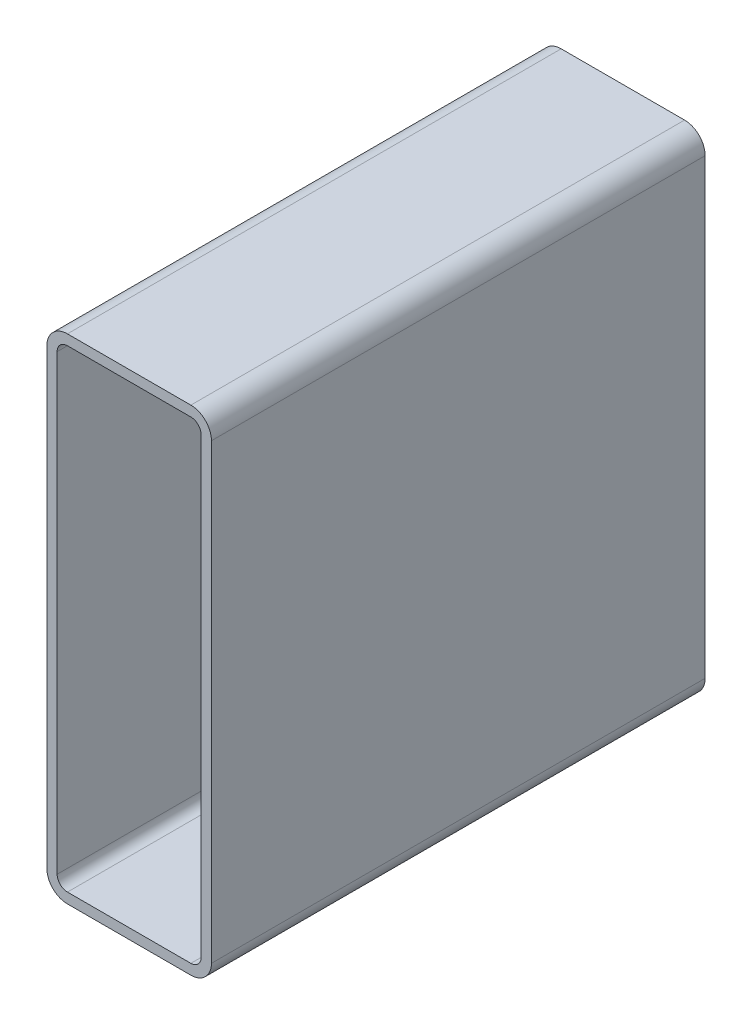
ISO-10303-21;
HEADER;
FILE_DESCRIPTION(('STEP AP214'),'2;1');
FILE_NAME('part.step','',(''),(''),'','','');
FILE_SCHEMA(('AUTOMOTIVE_DESIGN { 1 0 10303 214 1 1 1 1 }'));
ENDSEC;
DATA;
#1=APPLICATION_CONTEXT('core data for automotive mechanical design processes');
#2=APPLICATION_PROTOCOL_DEFINITION('international standard','automotive_design',2000,#1);
#3=PRODUCT_CONTEXT('',#1,'mechanical');
#4=PRODUCT('Part','Part','',(#3));
#5=PRODUCT_RELATED_PRODUCT_CATEGORY('part','',(#4));
#6=PRODUCT_DEFINITION_FORMATION('','',#4);
#7=PRODUCT_DEFINITION_CONTEXT('part definition',#1,'design');
#8=PRODUCT_DEFINITION('design','',#6,#7);
#9=PRODUCT_DEFINITION_SHAPE('','',#8);
#10=(LENGTH_UNIT() NAMED_UNIT(*) SI_UNIT(.MILLI.,.METRE.));
#11=(NAMED_UNIT(*) PLANE_ANGLE_UNIT() SI_UNIT($,.RADIAN.));
#12=(NAMED_UNIT(*) SI_UNIT($,.STERADIAN.) SOLID_ANGLE_UNIT());
#13=UNCERTAINTY_MEASURE_WITH_UNIT(LENGTH_MEASURE(1.E-05),#10,'distance_accuracy_value','');
#14=(GEOMETRIC_REPRESENTATION_CONTEXT(3) GLOBAL_UNCERTAINTY_ASSIGNED_CONTEXT((#13)) GLOBAL_UNIT_ASSIGNED_CONTEXT((#10,
#11,#12)) REPRESENTATION_CONTEXT('',''));
#15=CARTESIAN_POINT('',(0.,0.,0.));
#16=DIRECTION('',(0.,0.,1.));
#17=DIRECTION('',(1.,0.,0.));
#18=AXIS2_PLACEMENT_3D('',#15,#16,#17);
#19=CARTESIAN_POINT('',(14.3751778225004,293.974496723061,304.8));
#20=DIRECTION('',(0.,0.,1.));
#21=DIRECTION('',(1.,0.,0.));
#22=AXIS2_PLACEMENT_3D('',#19,#20,#21);
#23=PLANE('',#22);
#24=CARTESIAN_POINT('',(14.3751778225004,293.974496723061,304.8));
#25=DIRECTION('',(0.,0.,1.));
#26=DIRECTION('',(1.,0.,0.));
#27=AXIS2_PLACEMENT_3D('',#24,#25,#26);
#28=CIRCLE('',#27,12.7);
#29=CARTESIAN_POINT('',(14.3751778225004,306.674496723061,304.8));
#30=VERTEX_POINT('',#29);
#31=CARTESIAN_POINT('',(1.67517782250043,293.974496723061,304.8));
#32=VERTEX_POINT('',#31);
#33=EDGE_CURVE('E211',#30,#32,#28,.T.);
#34=ORIENTED_EDGE('',*,*,#33,.T.);
#35=DIRECTION('',(0.,-1.,0.));
#36=VECTOR('',#35,1.);
#37=CARTESIAN_POINT('',(1.67517782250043,14.5744967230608,304.8));
#38=LINE('',#37,#36);
#39=CARTESIAN_POINT('',(1.67517782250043,14.5744967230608,304.8));
#40=VERTEX_POINT('',#39);
#41=EDGE_CURVE('E214',#32,#40,#38,.T.);
#42=ORIENTED_EDGE('',*,*,#41,.T.);
#43=CARTESIAN_POINT('',(14.3751778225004,14.5744967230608,304.8));
#44=DIRECTION('',(0.,0.,1.));
#45=DIRECTION('',(1.,0.,0.));
#46=AXIS2_PLACEMENT_3D('',#43,#44,#45);
#47=CIRCLE('',#46,12.7);
#48=CARTESIAN_POINT('',(14.3751778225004,1.87449672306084,304.8));
#49=VERTEX_POINT('',#48);
#50=EDGE_CURVE('E217',#40,#49,#47,.T.);
#51=ORIENTED_EDGE('',*,*,#50,.T.);
#52=DIRECTION('',(1.,0.,0.));
#53=VECTOR('',#52,1.);
#54=CARTESIAN_POINT('',(90.5751778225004,1.87449672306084,304.8));
#55=LINE('',#54,#53);
#56=CARTESIAN_POINT('',(90.5751778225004,1.87449672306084,304.8));
#57=VERTEX_POINT('',#56);
#58=EDGE_CURVE('E219',#49,#57,#55,.T.);
#59=ORIENTED_EDGE('',*,*,#58,.T.);
#60=CARTESIAN_POINT('',(90.5751778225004,14.5744967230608,304.8));
#61=DIRECTION('',(0.,0.,1.));
#62=DIRECTION('',(1.,0.,0.));
#63=AXIS2_PLACEMENT_3D('',#60,#61,#62);
#64=CIRCLE('',#63,12.7);
#65=CARTESIAN_POINT('',(103.2751778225,14.5744967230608,304.8));
#66=VERTEX_POINT('',#65);
#67=EDGE_CURVE('E221',#57,#66,#64,.T.);
#68=ORIENTED_EDGE('',*,*,#67,.T.);
#69=DIRECTION('',(0.,1.,0.));
#70=VECTOR('',#69,1.);
#71=CARTESIAN_POINT('',(103.2751778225,293.974496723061,304.8));
#72=LINE('',#71,#70);
#73=CARTESIAN_POINT('',(103.2751778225,293.974496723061,304.8));
#74=VERTEX_POINT('',#73);
#75=EDGE_CURVE('E223',#66,#74,#72,.T.);
#76=ORIENTED_EDGE('',*,*,#75,.T.);
#77=CARTESIAN_POINT('',(90.5751778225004,293.974496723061,304.8));
#78=DIRECTION('',(0.,0.,1.));
#79=DIRECTION('',(1.,0.,0.));
#80=AXIS2_PLACEMENT_3D('',#77,#78,#79);
#81=CIRCLE('',#80,12.7);
#82=CARTESIAN_POINT('',(90.5751778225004,306.674496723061,304.8));
#83=VERTEX_POINT('',#82);
#84=EDGE_CURVE('E225',#74,#83,#81,.T.);
#85=ORIENTED_EDGE('',*,*,#84,.T.);
#86=DIRECTION('',(-1.,0.,0.));
#87=VECTOR('',#86,1.);
#88=CARTESIAN_POINT('',(14.3751778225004,306.674496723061,304.8));
#89=LINE('',#88,#87);
#90=EDGE_CURVE('E227',#83,#30,#89,.T.);
#91=ORIENTED_EDGE('',*,*,#90,.T.);
#92=EDGE_LOOP('',(#34,#42,#51,#59,#68,#76,#85,#91));
#93=FACE_BOUND('',#92,.T.);
#94=DIRECTION('',(0.,-1.,0.));
#95=VECTOR('',#94,1.);
#96=CARTESIAN_POINT('',(8.02517782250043,14.5744967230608,304.8));
#97=LINE('',#96,#95);
#98=CARTESIAN_POINT('',(8.02517782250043,293.974496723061,304.8));
#99=VERTEX_POINT('',#98);
#100=CARTESIAN_POINT('',(8.02517782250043,14.5744967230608,304.8));
#101=VERTEX_POINT('',#100);
#102=EDGE_CURVE('E154',#99,#101,#97,.T.);
#103=ORIENTED_EDGE('',*,*,#102,.F.);
#104=CARTESIAN_POINT('',(14.3751778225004,293.974496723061,304.8));
#105=DIRECTION('',(0.,0.,1.));
#106=DIRECTION('',(1.,0.,0.));
#107=AXIS2_PLACEMENT_3D('',#104,#105,#106);
#108=CIRCLE('',#107,6.35000000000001);
#109=CARTESIAN_POINT('',(14.3751778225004,300.324496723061,304.8));
#110=VERTEX_POINT('',#109);
#111=EDGE_CURVE('E146',#110,#99,#108,.T.);
#112=ORIENTED_EDGE('',*,*,#111,.F.);
#113=DIRECTION('',(-1.,0.,0.));
#114=VECTOR('',#113,1.);
#115=CARTESIAN_POINT('',(14.3751778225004,300.324496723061,304.8));
#116=LINE('',#115,#114);
#117=CARTESIAN_POINT('',(90.5751778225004,300.324496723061,304.8));
#118=VERTEX_POINT('',#117);
#119=EDGE_CURVE('E179',#118,#110,#116,.T.);
#120=ORIENTED_EDGE('',*,*,#119,.F.);
#121=CARTESIAN_POINT('',(90.5751778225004,293.974496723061,304.8));
#122=DIRECTION('',(0.,0.,1.));
#123=DIRECTION('',(1.,0.,0.));
#124=AXIS2_PLACEMENT_3D('',#121,#122,#123);
#125=CIRCLE('',#124,6.35000000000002);
#126=CARTESIAN_POINT('',(96.9251778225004,293.974496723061,304.8));
#127=VERTEX_POINT('',#126);
#128=EDGE_CURVE('E177',#127,#118,#125,.T.);
#129=ORIENTED_EDGE('',*,*,#128,.F.);
#130=DIRECTION('',(0.,1.,0.));
#131=VECTOR('',#130,1.);
#132=CARTESIAN_POINT('',(96.9251778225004,293.974496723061,304.8));
#133=LINE('',#132,#131);
#134=CARTESIAN_POINT('',(96.9251778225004,14.5744967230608,304.8));
#135=VERTEX_POINT('',#134);
#136=EDGE_CURVE('E175',#135,#127,#133,.T.);
#137=ORIENTED_EDGE('',*,*,#136,.F.);
#138=CARTESIAN_POINT('',(90.5751778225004,14.5744967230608,304.8));
#139=DIRECTION('',(0.,0.,1.));
#140=DIRECTION('',(1.,0.,0.));
#141=AXIS2_PLACEMENT_3D('',#138,#139,#140);
#142=CIRCLE('',#141,6.35000000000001);
#143=CARTESIAN_POINT('',(90.5751778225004,8.22449672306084,304.8));
#144=VERTEX_POINT('',#143);
#145=EDGE_CURVE('E173',#144,#135,#142,.T.);
#146=ORIENTED_EDGE('',*,*,#145,.F.);
#147=DIRECTION('',(1.,0.,0.));
#148=VECTOR('',#147,1.);
#149=CARTESIAN_POINT('',(90.5751778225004,8.22449672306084,304.8));
#150=LINE('',#149,#148);
#151=CARTESIAN_POINT('',(14.3751778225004,8.22449672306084,304.8));
#152=VERTEX_POINT('',#151);
#153=EDGE_CURVE('E169',#152,#144,#150,.T.);
#154=ORIENTED_EDGE('',*,*,#153,.F.);
#155=CARTESIAN_POINT('',(14.3751778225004,14.5744967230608,304.8));
#156=DIRECTION('',(0.,0.,1.));
#157=DIRECTION('',(1.,0.,0.));
#158=AXIS2_PLACEMENT_3D('',#155,#156,#157);
#159=CIRCLE('',#158,6.35);
#160=EDGE_CURVE('E167',#101,#152,#159,.T.);
#161=ORIENTED_EDGE('',*,*,#160,.F.);
#162=EDGE_LOOP('',(#103,#112,#120,#129,#137,#146,#154,#161));
#163=FACE_BOUND('',#162,.T.);
#164=ADVANCED_FACE('F33',(#93,#163),#23,.T.);
#165=CARTESIAN_POINT('',(14.3751778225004,293.974496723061,0.));
#166=DIRECTION('',(0.,0.,1.));
#167=DIRECTION('',(1.,0.,0.));
#168=AXIS2_PLACEMENT_3D('',#165,#166,#167);
#169=PLANE('',#168);
#170=CARTESIAN_POINT('',(14.3751778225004,293.974496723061,0.));
#171=DIRECTION('',(0.,0.,1.));
#172=DIRECTION('',(1.,0.,0.));
#173=AXIS2_PLACEMENT_3D('',#170,#171,#172);
#174=CIRCLE('',#173,12.7);
#175=CARTESIAN_POINT('',(14.3751778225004,306.674496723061,0.));
#176=VERTEX_POINT('',#175);
#177=CARTESIAN_POINT('',(1.67517782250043,293.974496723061,0.));
#178=VERTEX_POINT('',#177);
#179=EDGE_CURVE('E162',#176,#178,#174,.T.);
#180=ORIENTED_EDGE('',*,*,#179,.F.);
#181=DIRECTION('',(-1.,0.,0.));
#182=VECTOR('',#181,1.);
#183=CARTESIAN_POINT('',(14.3751778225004,306.674496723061,0.));
#184=LINE('',#183,#182);
#185=CARTESIAN_POINT('',(90.5751778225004,306.674496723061,0.));
#186=VERTEX_POINT('',#185);
#187=EDGE_CURVE('E215',#186,#176,#184,.T.);
#188=ORIENTED_EDGE('',*,*,#187,.F.);
#189=CARTESIAN_POINT('',(90.5751778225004,293.974496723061,0.));
#190=DIRECTION('',(0.,0.,1.));
#191=DIRECTION('',(1.,0.,0.));
#192=AXIS2_PLACEMENT_3D('',#189,#190,#191);
#193=CIRCLE('',#192,12.7);
#194=CARTESIAN_POINT('',(103.2751778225,293.974496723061,0.));
#195=VERTEX_POINT('',#194);
#196=EDGE_CURVE('E242',#195,#186,#193,.T.);
#197=ORIENTED_EDGE('',*,*,#196,.F.);
#198=DIRECTION('',(0.,1.,0.));
#199=VECTOR('',#198,1.);
#200=CARTESIAN_POINT('',(103.2751778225,293.974496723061,0.));
#201=LINE('',#200,#199);
#202=CARTESIAN_POINT('',(103.2751778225,14.5744967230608,0.));
#203=VERTEX_POINT('',#202);
#204=EDGE_CURVE('E240',#203,#195,#201,.T.);
#205=ORIENTED_EDGE('',*,*,#204,.F.);
#206=CARTESIAN_POINT('',(90.5751778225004,14.5744967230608,0.));
#207=DIRECTION('',(0.,0.,1.));
#208=DIRECTION('',(1.,0.,0.));
#209=AXIS2_PLACEMENT_3D('',#206,#207,#208);
#210=CIRCLE('',#209,12.7);
#211=CARTESIAN_POINT('',(90.5751778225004,1.87449672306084,0.));
#212=VERTEX_POINT('',#211);
#213=EDGE_CURVE('E238',#212,#203,#210,.T.);
#214=ORIENTED_EDGE('',*,*,#213,.F.);
#215=DIRECTION('',(1.,0.,0.));
#216=VECTOR('',#215,1.);
#217=CARTESIAN_POINT('',(90.5751778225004,1.87449672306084,0.));
#218=LINE('',#217,#216);
#219=CARTESIAN_POINT('',(14.3751778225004,1.87449672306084,0.));
#220=VERTEX_POINT('',#219);
#221=EDGE_CURVE('E236',#220,#212,#218,.T.);
#222=ORIENTED_EDGE('',*,*,#221,.F.);
#223=CARTESIAN_POINT('',(14.3751778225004,14.5744967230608,0.));
#224=DIRECTION('',(0.,0.,1.));
#225=DIRECTION('',(1.,0.,0.));
#226=AXIS2_PLACEMENT_3D('',#223,#224,#225);
#227=CIRCLE('',#226,12.7);
#228=CARTESIAN_POINT('',(1.67517782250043,14.5744967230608,0.));
#229=VERTEX_POINT('',#228);
#230=EDGE_CURVE('E234',#229,#220,#227,.T.);
#231=ORIENTED_EDGE('',*,*,#230,.F.);
#232=DIRECTION('',(0.,-1.,0.));
#233=VECTOR('',#232,1.);
#234=CARTESIAN_POINT('',(1.67517782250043,14.5744967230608,0.));
#235=LINE('',#234,#233);
#236=EDGE_CURVE('E232',#178,#229,#235,.T.);
#237=ORIENTED_EDGE('',*,*,#236,.F.);
#238=EDGE_LOOP('',(#180,#188,#197,#205,#214,#222,#231,#237));
#239=FACE_BOUND('',#238,.T.);
#240=CARTESIAN_POINT('',(14.3751778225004,293.974496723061,0.));
#241=DIRECTION('',(0.,0.,1.));
#242=DIRECTION('',(1.,0.,0.));
#243=AXIS2_PLACEMENT_3D('',#240,#241,#242);
#244=CIRCLE('',#243,6.35000000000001);
#245=CARTESIAN_POINT('',(14.3751778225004,300.324496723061,0.));
#246=VERTEX_POINT('',#245);
#247=CARTESIAN_POINT('',(8.02517782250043,293.974496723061,0.));
#248=VERTEX_POINT('',#247);
#249=EDGE_CURVE('E56',#246,#248,#244,.T.);
#250=ORIENTED_EDGE('',*,*,#249,.T.);
#251=DIRECTION('',(0.,-1.,0.));
#252=VECTOR('',#251,1.);
#253=CARTESIAN_POINT('',(8.02517782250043,14.5744967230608,0.));
#254=LINE('',#253,#252);
#255=CARTESIAN_POINT('',(8.02517782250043,14.5744967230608,0.));
#256=VERTEX_POINT('',#255);
#257=EDGE_CURVE('E161',#248,#256,#254,.T.);
#258=ORIENTED_EDGE('',*,*,#257,.T.);
#259=CARTESIAN_POINT('',(14.3751778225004,14.5744967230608,0.));
#260=DIRECTION('',(0.,0.,1.));
#261=DIRECTION('',(1.,0.,0.));
#262=AXIS2_PLACEMENT_3D('',#259,#260,#261);
#263=CIRCLE('',#262,6.35);
#264=CARTESIAN_POINT('',(14.3751778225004,8.22449672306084,0.));
#265=VERTEX_POINT('',#264);
#266=EDGE_CURVE('E183',#256,#265,#263,.T.);
#267=ORIENTED_EDGE('',*,*,#266,.T.);
#268=DIRECTION('',(1.,0.,0.));
#269=VECTOR('',#268,1.);
#270=CARTESIAN_POINT('',(90.5751778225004,8.22449672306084,0.));
#271=LINE('',#270,#269);
#272=CARTESIAN_POINT('',(90.5751778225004,8.22449672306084,0.));
#273=VERTEX_POINT('',#272);
#274=EDGE_CURVE('E186',#265,#273,#271,.T.);
#275=ORIENTED_EDGE('',*,*,#274,.T.);
#276=CARTESIAN_POINT('',(90.5751778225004,14.5744967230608,0.));
#277=DIRECTION('',(0.,0.,1.));
#278=DIRECTION('',(1.,0.,0.));
#279=AXIS2_PLACEMENT_3D('',#276,#277,#278);
#280=CIRCLE('',#279,6.35000000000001);
#281=CARTESIAN_POINT('',(96.9251778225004,14.5744967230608,0.));
#282=VERTEX_POINT('',#281);
#283=EDGE_CURVE('E189',#273,#282,#280,.T.);
#284=ORIENTED_EDGE('',*,*,#283,.T.);
#285=DIRECTION('',(0.,1.,0.));
#286=VECTOR('',#285,1.);
#287=CARTESIAN_POINT('',(96.9251778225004,293.974496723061,0.));
#288=LINE('',#287,#286);
#289=CARTESIAN_POINT('',(96.9251778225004,293.974496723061,0.));
#290=VERTEX_POINT('',#289);
#291=EDGE_CURVE('E192',#282,#290,#288,.T.);
#292=ORIENTED_EDGE('',*,*,#291,.T.);
#293=CARTESIAN_POINT('',(90.5751778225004,293.974496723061,0.));
#294=DIRECTION('',(0.,0.,1.));
#295=DIRECTION('',(1.,0.,0.));
#296=AXIS2_PLACEMENT_3D('',#293,#294,#295);
#297=CIRCLE('',#296,6.35000000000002);
#298=CARTESIAN_POINT('',(90.5751778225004,300.324496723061,0.));
#299=VERTEX_POINT('',#298);
#300=EDGE_CURVE('E195',#290,#299,#297,.T.);
#301=ORIENTED_EDGE('',*,*,#300,.T.);
#302=DIRECTION('',(-1.,0.,0.));
#303=VECTOR('',#302,1.);
#304=CARTESIAN_POINT('',(14.3751778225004,300.324496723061,0.));
#305=LINE('',#304,#303);
#306=EDGE_CURVE('E155',#299,#246,#305,.T.);
#307=ORIENTED_EDGE('',*,*,#306,.T.);
#308=EDGE_LOOP('',(#250,#258,#267,#275,#284,#292,#301,#307));
#309=FACE_BOUND('',#308,.T.);
#310=ADVANCED_FACE('F272',(#239,#309),#169,.F.);
#311=CARTESIAN_POINT('',(14.3751778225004,293.974496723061,304.8));
#312=DIRECTION('',(0.,0.,-1.));
#313=DIRECTION('',(-1.,0.,0.));
#314=AXIS2_PLACEMENT_3D('',#311,#312,#313);
#315=CYLINDRICAL_SURFACE('',#314,12.7);
#316=ORIENTED_EDGE('',*,*,#179,.T.);
#317=DIRECTION('',(0.,0.,-1.));
#318=VECTOR('',#317,1.);
#319=CARTESIAN_POINT('',(1.67517782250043,293.974496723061,304.8));
#320=LINE('',#319,#318);
#321=EDGE_CURVE('E11',#32,#178,#320,.T.);
#322=ORIENTED_EDGE('',*,*,#321,.F.);
#323=ORIENTED_EDGE('',*,*,#33,.F.);
#324=DIRECTION('',(0.,0.,-1.));
#325=VECTOR('',#324,1.);
#326=CARTESIAN_POINT('',(14.3751778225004,306.674496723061,304.8));
#327=LINE('',#326,#325);
#328=EDGE_CURVE('E229',#30,#176,#327,.T.);
#329=ORIENTED_EDGE('',*,*,#328,.T.);
#330=EDGE_LOOP('',(#316,#322,#323,#329));
#331=FACE_BOUND('',#330,.T.);
#332=ADVANCED_FACE('F35',(#331),#315,.T.);
#333=CARTESIAN_POINT('',(1.67517782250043,14.5744967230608,304.8));
#334=DIRECTION('',(1.,0.,0.));
#335=DIRECTION('',(0.,0.,-1.));
#336=AXIS2_PLACEMENT_3D('',#333,#334,#335);
#337=PLANE('',#336);
#338=ORIENTED_EDGE('',*,*,#236,.T.);
#339=DIRECTION('',(0.,0.,-1.));
#340=VECTOR('',#339,1.);
#341=CARTESIAN_POINT('',(1.67517782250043,14.5744967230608,304.8));
#342=LINE('',#341,#340);
#343=EDGE_CURVE('E41',#40,#229,#342,.T.);
#344=ORIENTED_EDGE('',*,*,#343,.F.);
#345=ORIENTED_EDGE('',*,*,#41,.F.);
#346=ORIENTED_EDGE('',*,*,#321,.T.);
#347=EDGE_LOOP('',(#338,#344,#345,#346));
#348=FACE_BOUND('',#347,.T.);
#349=ADVANCED_FACE('F289',(#348),#337,.F.);
#350=CARTESIAN_POINT('',(14.3751778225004,14.5744967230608,304.8));
#351=DIRECTION('',(0.,0.,-1.));
#352=DIRECTION('',(-1.,0.,0.));
#353=AXIS2_PLACEMENT_3D('',#350,#351,#352);
#354=CYLINDRICAL_SURFACE('',#353,12.7);
#355=ORIENTED_EDGE('',*,*,#230,.T.);
#356=DIRECTION('',(0.,0.,-1.));
#357=VECTOR('',#356,1.);
#358=CARTESIAN_POINT('',(14.3751778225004,1.87449672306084,304.8));
#359=LINE('',#358,#357);
#360=EDGE_CURVE('E259',#49,#220,#359,.T.);
#361=ORIENTED_EDGE('',*,*,#360,.F.);
#362=ORIENTED_EDGE('',*,*,#50,.F.);
#363=ORIENTED_EDGE('',*,*,#343,.T.);
#364=EDGE_LOOP('',(#355,#361,#362,#363));
#365=FACE_BOUND('',#364,.T.);
#366=ADVANCED_FACE('F266',(#365),#354,.T.);
#367=CARTESIAN_POINT('',(90.5751778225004,1.87449672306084,304.8));
#368=DIRECTION('',(0.,1.,0.));
#369=DIRECTION('',(0.,0.,1.));
#370=AXIS2_PLACEMENT_3D('',#367,#368,#369);
#371=PLANE('',#370);
#372=ORIENTED_EDGE('',*,*,#221,.T.);
#373=DIRECTION('',(0.,0.,-1.));
#374=VECTOR('',#373,1.);
#375=CARTESIAN_POINT('',(90.5751778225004,1.87449672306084,304.8));
#376=LINE('',#375,#374);
#377=EDGE_CURVE('E256',#57,#212,#376,.T.);
#378=ORIENTED_EDGE('',*,*,#377,.F.);
#379=ORIENTED_EDGE('',*,*,#58,.F.);
#380=ORIENTED_EDGE('',*,*,#360,.T.);
#381=EDGE_LOOP('',(#372,#378,#379,#380));
#382=FACE_BOUND('',#381,.T.);
#383=ADVANCED_FACE('F278',(#382),#371,.F.);
#384=CARTESIAN_POINT('',(90.5751778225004,14.5744967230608,304.8));
#385=DIRECTION('',(0.,0.,-1.));
#386=DIRECTION('',(-1.,0.,0.));
#387=AXIS2_PLACEMENT_3D('',#384,#385,#386);
#388=CYLINDRICAL_SURFACE('',#387,12.7);
#389=ORIENTED_EDGE('',*,*,#213,.T.);
#390=DIRECTION('',(0.,0.,-1.));
#391=VECTOR('',#390,1.);
#392=CARTESIAN_POINT('',(103.2751778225,14.5744967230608,304.8));
#393=LINE('',#392,#391);
#394=EDGE_CURVE('E253',#66,#203,#393,.T.);
#395=ORIENTED_EDGE('',*,*,#394,.F.);
#396=ORIENTED_EDGE('',*,*,#67,.F.);
#397=ORIENTED_EDGE('',*,*,#377,.T.);
#398=EDGE_LOOP('',(#389,#395,#396,#397));
#399=FACE_BOUND('',#398,.T.);
#400=ADVANCED_FACE('F282',(#399),#388,.T.);
#401=CARTESIAN_POINT('',(103.2751778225,293.974496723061,304.8));
#402=DIRECTION('',(-1.,0.,0.));
#403=DIRECTION('',(0.,0.,1.));
#404=AXIS2_PLACEMENT_3D('',#401,#402,#403);
#405=PLANE('',#404);
#406=ORIENTED_EDGE('',*,*,#204,.T.);
#407=DIRECTION('',(0.,0.,-1.));
#408=VECTOR('',#407,1.);
#409=CARTESIAN_POINT('',(103.2751778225,293.974496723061,304.8));
#410=LINE('',#409,#408);
#411=EDGE_CURVE('E250',#74,#195,#410,.T.);
#412=ORIENTED_EDGE('',*,*,#411,.F.);
#413=ORIENTED_EDGE('',*,*,#75,.F.);
#414=ORIENTED_EDGE('',*,*,#394,.T.);
#415=EDGE_LOOP('',(#406,#412,#413,#414));
#416=FACE_BOUND('',#415,.T.);
#417=ADVANCED_FACE('F302',(#416),#405,.F.);
#418=CARTESIAN_POINT('',(90.5751778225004,293.974496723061,304.8));
#419=DIRECTION('',(0.,0.,-1.));
#420=DIRECTION('',(-1.,0.,0.));
#421=AXIS2_PLACEMENT_3D('',#418,#419,#420);
#422=CYLINDRICAL_SURFACE('',#421,12.7);
#423=ORIENTED_EDGE('',*,*,#196,.T.);
#424=DIRECTION('',(0.,0.,-1.));
#425=VECTOR('',#424,1.);
#426=CARTESIAN_POINT('',(90.5751778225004,306.674496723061,304.8));
#427=LINE('',#426,#425);
#428=EDGE_CURVE('E247',#83,#186,#427,.T.);
#429=ORIENTED_EDGE('',*,*,#428,.F.);
#430=ORIENTED_EDGE('',*,*,#84,.F.);
#431=ORIENTED_EDGE('',*,*,#411,.T.);
#432=EDGE_LOOP('',(#423,#429,#430,#431));
#433=FACE_BOUND('',#432,.T.);
#434=ADVANCED_FACE('F300',(#433),#422,.T.);
#435=CARTESIAN_POINT('',(14.3751778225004,306.674496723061,304.8));
#436=DIRECTION('',(0.,-1.,0.));
#437=DIRECTION('',(0.,0.,-1.));
#438=AXIS2_PLACEMENT_3D('',#435,#436,#437);
#439=PLANE('',#438);
#440=ORIENTED_EDGE('',*,*,#187,.T.);
#441=ORIENTED_EDGE('',*,*,#328,.F.);
#442=ORIENTED_EDGE('',*,*,#90,.F.);
#443=ORIENTED_EDGE('',*,*,#428,.T.);
#444=EDGE_LOOP('',(#440,#441,#442,#443));
#445=FACE_BOUND('',#444,.T.);
#446=ADVANCED_FACE('F295',(#445),#439,.F.);
#447=CARTESIAN_POINT('',(14.3751778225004,293.974496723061,304.8));
#448=DIRECTION('',(0.,0.,-1.));
#449=DIRECTION('',(-1.,0.,0.));
#450=AXIS2_PLACEMENT_3D('',#447,#448,#449);
#451=CYLINDRICAL_SURFACE('',#450,6.35000000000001);
#452=ORIENTED_EDGE('',*,*,#249,.F.);
#453=DIRECTION('',(0.,0.,-1.));
#454=VECTOR('',#453,1.);
#455=CARTESIAN_POINT('',(14.3751778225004,300.324496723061,304.8));
#456=LINE('',#455,#454);
#457=EDGE_CURVE('E150',#110,#246,#456,.T.);
#458=ORIENTED_EDGE('',*,*,#457,.F.);
#459=ORIENTED_EDGE('',*,*,#111,.T.);
#460=DIRECTION('',(0.,0.,-1.));
#461=VECTOR('',#460,1.);
#462=CARTESIAN_POINT('',(8.02517782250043,293.974496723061,304.8));
#463=LINE('',#462,#461);
#464=EDGE_CURVE('E149',#99,#248,#463,.T.);
#465=ORIENTED_EDGE('',*,*,#464,.T.);
#466=EDGE_LOOP('',(#452,#458,#459,#465));
#467=FACE_BOUND('',#466,.T.);
#468=ADVANCED_FACE('F148',(#467),#451,.F.);
#469=CARTESIAN_POINT('',(8.02517782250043,14.5744967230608,304.8));
#470=DIRECTION('',(1.,0.,0.));
#471=DIRECTION('',(0.,0.,-1.));
#472=AXIS2_PLACEMENT_3D('',#469,#470,#471);
#473=PLANE('',#472);
#474=ORIENTED_EDGE('',*,*,#257,.F.);
#475=ORIENTED_EDGE('',*,*,#464,.F.);
#476=ORIENTED_EDGE('',*,*,#102,.T.);
#477=DIRECTION('',(0.,0.,-1.));
#478=VECTOR('',#477,1.);
#479=CARTESIAN_POINT('',(8.02517782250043,14.5744967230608,304.8));
#480=LINE('',#479,#478);
#481=EDGE_CURVE('E163',#101,#256,#480,.T.);
#482=ORIENTED_EDGE('',*,*,#481,.T.);
#483=EDGE_LOOP('',(#474,#475,#476,#482));
#484=FACE_BOUND('',#483,.T.);
#485=ADVANCED_FACE('F158',(#484),#473,.T.);
#486=CARTESIAN_POINT('',(14.3751778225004,14.5744967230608,304.8));
#487=DIRECTION('',(0.,0.,-1.));
#488=DIRECTION('',(-1.,0.,0.));
#489=AXIS2_PLACEMENT_3D('',#486,#487,#488);
#490=CYLINDRICAL_SURFACE('',#489,6.35);
#491=ORIENTED_EDGE('',*,*,#266,.F.);
#492=ORIENTED_EDGE('',*,*,#481,.F.);
#493=ORIENTED_EDGE('',*,*,#160,.T.);
#494=DIRECTION('',(0.,0.,-1.));
#495=VECTOR('',#494,1.);
#496=CARTESIAN_POINT('',(14.3751778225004,8.22449672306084,304.8));
#497=LINE('',#496,#495);
#498=EDGE_CURVE('E208',#152,#265,#497,.T.);
#499=ORIENTED_EDGE('',*,*,#498,.T.);
#500=EDGE_LOOP('',(#491,#492,#493,#499));
#501=FACE_BOUND('',#500,.T.);
#502=ADVANCED_FACE('F327',(#501),#490,.F.);
#503=CARTESIAN_POINT('',(90.5751778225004,8.22449672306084,304.8));
#504=DIRECTION('',(0.,1.,0.));
#505=DIRECTION('',(0.,0.,1.));
#506=AXIS2_PLACEMENT_3D('',#503,#504,#505);
#507=PLANE('',#506);
#508=ORIENTED_EDGE('',*,*,#274,.F.);
#509=ORIENTED_EDGE('',*,*,#498,.F.);
#510=ORIENTED_EDGE('',*,*,#153,.T.);
#511=DIRECTION('',(0.,0.,-1.));
#512=VECTOR('',#511,1.);
#513=CARTESIAN_POINT('',(90.5751778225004,8.22449672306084,304.8));
#514=LINE('',#513,#512);
#515=EDGE_CURVE('E206',#144,#273,#514,.T.);
#516=ORIENTED_EDGE('',*,*,#515,.T.);
#517=EDGE_LOOP('',(#508,#509,#510,#516));
#518=FACE_BOUND('',#517,.T.);
#519=ADVANCED_FACE('F331',(#518),#507,.T.);
#520=CARTESIAN_POINT('',(90.5751778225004,14.5744967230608,304.8));
#521=DIRECTION('',(0.,0.,-1.));
#522=DIRECTION('',(-1.,0.,0.));
#523=AXIS2_PLACEMENT_3D('',#520,#521,#522);
#524=CYLINDRICAL_SURFACE('',#523,6.35000000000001);
#525=ORIENTED_EDGE('',*,*,#283,.F.);
#526=ORIENTED_EDGE('',*,*,#515,.F.);
#527=ORIENTED_EDGE('',*,*,#145,.T.);
#528=DIRECTION('',(0.,0.,-1.));
#529=VECTOR('',#528,1.);
#530=CARTESIAN_POINT('',(96.9251778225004,14.5744967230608,304.8));
#531=LINE('',#530,#529);
#532=EDGE_CURVE('E204',#135,#282,#531,.T.);
#533=ORIENTED_EDGE('',*,*,#532,.T.);
#534=EDGE_LOOP('',(#525,#526,#527,#533));
#535=FACE_BOUND('',#534,.T.);
#536=ADVANCED_FACE('F337',(#535),#524,.F.);
#537=CARTESIAN_POINT('',(96.9251778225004,293.974496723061,304.8));
#538=DIRECTION('',(-1.,0.,0.));
#539=DIRECTION('',(0.,0.,1.));
#540=AXIS2_PLACEMENT_3D('',#537,#538,#539);
#541=PLANE('',#540);
#542=ORIENTED_EDGE('',*,*,#291,.F.);
#543=ORIENTED_EDGE('',*,*,#532,.F.);
#544=ORIENTED_EDGE('',*,*,#136,.T.);
#545=DIRECTION('',(0.,0.,-1.));
#546=VECTOR('',#545,1.);
#547=CARTESIAN_POINT('',(96.9251778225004,293.974496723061,304.8));
#548=LINE('',#547,#546);
#549=EDGE_CURVE('E202',#127,#290,#548,.T.);
#550=ORIENTED_EDGE('',*,*,#549,.T.);
#551=EDGE_LOOP('',(#542,#543,#544,#550));
#552=FACE_BOUND('',#551,.T.);
#553=ADVANCED_FACE('F341',(#552),#541,.T.);
#554=CARTESIAN_POINT('',(90.5751778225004,293.974496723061,304.8));
#555=DIRECTION('',(0.,0.,-1.));
#556=DIRECTION('',(-1.,0.,0.));
#557=AXIS2_PLACEMENT_3D('',#554,#555,#556);
#558=CYLINDRICAL_SURFACE('',#557,6.35000000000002);
#559=ORIENTED_EDGE('',*,*,#300,.F.);
#560=ORIENTED_EDGE('',*,*,#549,.F.);
#561=ORIENTED_EDGE('',*,*,#128,.T.);
#562=DIRECTION('',(0.,0.,-1.));
#563=VECTOR('',#562,1.);
#564=CARTESIAN_POINT('',(90.5751778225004,300.324496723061,304.8));
#565=LINE('',#564,#563);
#566=EDGE_CURVE('E48',#118,#299,#565,.T.);
#567=ORIENTED_EDGE('',*,*,#566,.T.);
#568=EDGE_LOOP('',(#559,#560,#561,#567));
#569=FACE_BOUND('',#568,.T.);
#570=ADVANCED_FACE('F345',(#569),#558,.F.);
#571=CARTESIAN_POINT('',(14.3751778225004,300.324496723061,304.8));
#572=DIRECTION('',(0.,-1.,0.));
#573=DIRECTION('',(0.,0.,-1.));
#574=AXIS2_PLACEMENT_3D('',#571,#572,#573);
#575=PLANE('',#574);
#576=ORIENTED_EDGE('',*,*,#306,.F.);
#577=ORIENTED_EDGE('',*,*,#566,.F.);
#578=ORIENTED_EDGE('',*,*,#119,.T.);
#579=ORIENTED_EDGE('',*,*,#457,.T.);
#580=EDGE_LOOP('',(#576,#577,#578,#579));
#581=FACE_BOUND('',#580,.T.);
#582=ADVANCED_FACE('F349',(#581),#575,.T.);
#583=CLOSED_SHELL('',(#164,#310,#332,#349,#366,#383,#400,#417,#434,#446,#468,#485,#502,#519,
#536,#553,#570,#582));
#584=MANIFOLD_SOLID_BREP('B2',#583);
#585=ADVANCED_BREP_SHAPE_REPRESENTATION('',(#18,#584),#14);
#586=SHAPE_DEFINITION_REPRESENTATION(#9,#585);
ENDSEC;
END-ISO-10303-21;
